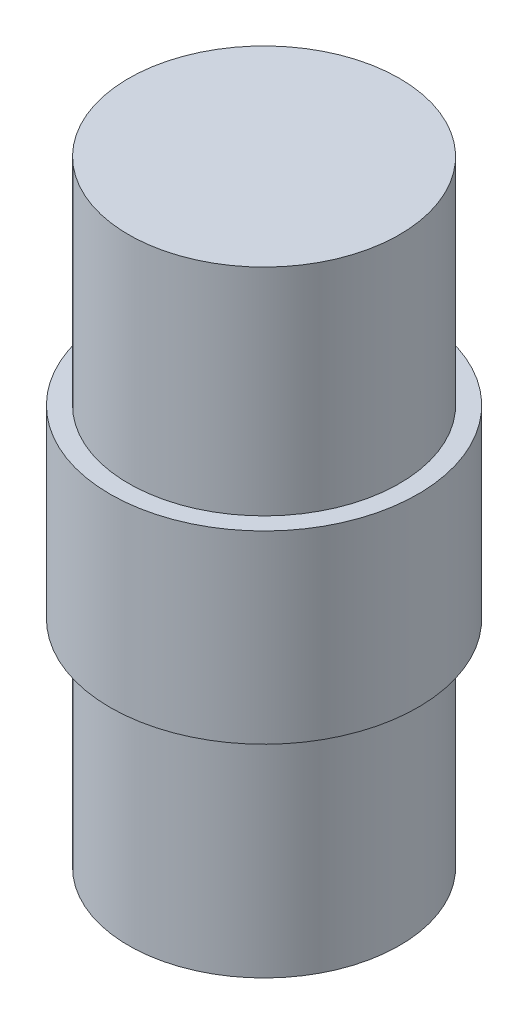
ISO-10303-21;
HEADER;
FILE_DESCRIPTION(('STEP AP214'),'2;1');
FILE_NAME('part.step','',(''),(''),'','','');
FILE_SCHEMA(('AUTOMOTIVE_DESIGN { 1 0 10303 214 1 1 1 1 }'));
ENDSEC;
DATA;
#1=APPLICATION_CONTEXT('core data for automotive mechanical design processes');
#2=APPLICATION_PROTOCOL_DEFINITION('international standard','automotive_design',2000,#1);
#3=PRODUCT_CONTEXT('',#1,'mechanical');
#4=PRODUCT('Part','Part','',(#3));
#5=PRODUCT_RELATED_PRODUCT_CATEGORY('part','',(#4));
#6=PRODUCT_DEFINITION_FORMATION('','',#4);
#7=PRODUCT_DEFINITION_CONTEXT('part definition',#1,'design');
#8=PRODUCT_DEFINITION('design','',#6,#7);
#9=PRODUCT_DEFINITION_SHAPE('','',#8);
#10=(LENGTH_UNIT() NAMED_UNIT(*) SI_UNIT(.MILLI.,.METRE.));
#11=(NAMED_UNIT(*) PLANE_ANGLE_UNIT() SI_UNIT($,.RADIAN.));
#12=(NAMED_UNIT(*) SI_UNIT($,.STERADIAN.) SOLID_ANGLE_UNIT());
#13=UNCERTAINTY_MEASURE_WITH_UNIT(LENGTH_MEASURE(1.E-05),#10,'distance_accuracy_value','');
#14=(GEOMETRIC_REPRESENTATION_CONTEXT(3) GLOBAL_UNCERTAINTY_ASSIGNED_CONTEXT((#13)) GLOBAL_UNIT_ASSIGNED_CONTEXT((#10,
#11,#12)) REPRESENTATION_CONTEXT('',''));
#15=CARTESIAN_POINT('',(0.,0.,0.));
#16=DIRECTION('',(0.,0.,1.));
#17=DIRECTION('',(1.,0.,0.));
#18=AXIS2_PLACEMENT_3D('',#15,#16,#17);
#19=CARTESIAN_POINT('',(0.,15.,0.));
#20=DIRECTION('',(0.,1.,0.));
#21=DIRECTION('',(0.,0.,1.));
#22=AXIS2_PLACEMENT_3D('',#19,#20,#21);
#23=PLANE('',#22);
#24=CARTESIAN_POINT('',(0.,15.,0.));
#25=DIRECTION('',(0.,1.,0.));
#26=DIRECTION('',(0.,0.,1.));
#27=AXIS2_PLACEMENT_3D('',#24,#25,#26);
#28=CIRCLE('',#27,25.);
#29=CARTESIAN_POINT('',(0.,15.,25.));
#30=VERTEX_POINT('',#29);
#31=EDGE_CURVE('E10',#30,#30,#28,.T.);
#32=ORIENTED_EDGE('',*,*,#31,.T.);
#33=EDGE_LOOP('',(#32));
#34=FACE_BOUND('',#33,.T.);
#35=CARTESIAN_POINT('',(0.,15.,0.));
#36=DIRECTION('',(0.,1.,0.));
#37=DIRECTION('',(0.,0.,1.));
#38=AXIS2_PLACEMENT_3D('',#35,#36,#37);
#39=CIRCLE('',#38,22.);
#40=CARTESIAN_POINT('',(0.,15.,-22.));
#41=VERTEX_POINT('',#40);
#42=EDGE_CURVE('E42',#41,#41,#39,.T.);
#43=ORIENTED_EDGE('',*,*,#42,.F.);
#44=EDGE_LOOP('',(#43));
#45=FACE_BOUND('',#44,.T.);
#46=ADVANCED_FACE('F31',(#34,#45),#23,.T.);
#47=CARTESIAN_POINT('',(0.,-15.,0.));
#48=DIRECTION('',(0.,1.,0.));
#49=DIRECTION('',(0.,0.,1.));
#50=AXIS2_PLACEMENT_3D('',#47,#48,#49);
#51=PLANE('',#50);
#52=CARTESIAN_POINT('',(0.,-15.,0.));
#53=DIRECTION('',(0.,1.,0.));
#54=DIRECTION('',(0.,0.,1.));
#55=AXIS2_PLACEMENT_3D('',#52,#53,#54);
#56=CIRCLE('',#55,25.);
#57=CARTESIAN_POINT('',(0.,-15.,25.));
#58=VERTEX_POINT('',#57);
#59=EDGE_CURVE('E38',#58,#58,#56,.T.);
#60=ORIENTED_EDGE('',*,*,#59,.F.);
#61=EDGE_LOOP('',(#60));
#62=FACE_BOUND('',#61,.T.);
#63=CARTESIAN_POINT('',(0.,-15.,0.));
#64=DIRECTION('',(0.,1.,0.));
#65=DIRECTION('',(0.,0.,1.));
#66=AXIS2_PLACEMENT_3D('',#63,#64,#65);
#67=CIRCLE('',#66,22.);
#68=CARTESIAN_POINT('',(0.,-15.,-22.));
#69=VERTEX_POINT('',#68);
#70=EDGE_CURVE('E46',#69,#69,#67,.F.);
#71=ORIENTED_EDGE('',*,*,#70,.F.);
#72=EDGE_LOOP('',(#71));
#73=FACE_BOUND('',#72,.T.);
#74=ADVANCED_FACE('F70',(#62,#73),#51,.F.);
#75=CARTESIAN_POINT('',(0.,15.,0.));
#76=DIRECTION('',(0.,-1.,0.));
#77=DIRECTION('',(0.,0.,-1.));
#78=AXIS2_PLACEMENT_3D('',#75,#76,#77);
#79=CYLINDRICAL_SURFACE('',#78,25.);
#80=ORIENTED_EDGE('',*,*,#31,.F.);
#81=EDGE_LOOP('',(#80));
#82=FACE_BOUND('',#81,.T.);
#83=ORIENTED_EDGE('',*,*,#59,.T.);
#84=EDGE_LOOP('',(#83));
#85=FACE_BOUND('',#84,.T.);
#86=ADVANCED_FACE('F33',(#82,#85),#79,.T.);
#87=CARTESIAN_POINT('',(0.,-50.,0.));
#88=DIRECTION('',(0.,1.,0.));
#89=DIRECTION('',(0.,0.,1.));
#90=AXIS2_PLACEMENT_3D('',#87,#88,#89);
#91=PLANE('',#90);
#92=CARTESIAN_POINT('',(0.,-50.,0.));
#93=DIRECTION('',(0.,1.,0.));
#94=DIRECTION('',(0.,0.,1.));
#95=AXIS2_PLACEMENT_3D('',#92,#93,#94);
#96=CIRCLE('',#95,22.);
#97=CARTESIAN_POINT('',(0.,-50.,-22.));
#98=VERTEX_POINT('',#97);
#99=EDGE_CURVE('E54',#98,#98,#96,.T.);
#100=ORIENTED_EDGE('',*,*,#99,.F.);
#101=EDGE_LOOP('',(#100));
#102=FACE_BOUND('',#101,.T.);
#103=ADVANCED_FACE('F61',(#102),#91,.F.);
#104=CARTESIAN_POINT('',(0.,50.,0.));
#105=DIRECTION('',(0.,-1.,0.));
#106=DIRECTION('',(0.,0.,-1.));
#107=AXIS2_PLACEMENT_3D('',#104,#105,#106);
#108=CYLINDRICAL_SURFACE('',#107,22.);
#109=CARTESIAN_POINT('',(0.,-50.,-22.));
#110=CARTESIAN_POINT('',(0.,-49.6354166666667,-22.));
#111=CARTESIAN_POINT('',(0.,-49.2708333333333,-22.));
#112=CARTESIAN_POINT('',(0.,-48.5416666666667,-22.));
#113=CARTESIAN_POINT('',(0.,-48.1770833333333,-22.));
#114=CARTESIAN_POINT('',(0.,-47.4479166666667,-22.));
#115=CARTESIAN_POINT('',(0.,-47.0833333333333,-22.));
#116=CARTESIAN_POINT('',(0.,-46.3541666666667,-22.));
#117=CARTESIAN_POINT('',(0.,-45.9895833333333,-22.));
#118=CARTESIAN_POINT('',(0.,-45.2604166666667,-22.));
#119=CARTESIAN_POINT('',(0.,-44.8958333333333,-22.));
#120=CARTESIAN_POINT('',(0.,-44.1666666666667,-22.));
#121=CARTESIAN_POINT('',(0.,-43.8020833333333,-22.));
#122=CARTESIAN_POINT('',(0.,-43.0729166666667,-22.));
#123=CARTESIAN_POINT('',(0.,-42.7083333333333,-22.));
#124=CARTESIAN_POINT('',(0.,-41.9791666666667,-22.));
#125=CARTESIAN_POINT('',(0.,-41.6145833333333,-22.));
#126=CARTESIAN_POINT('',(0.,-40.8854166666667,-22.));
#127=CARTESIAN_POINT('',(0.,-40.5208333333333,-22.));
#128=CARTESIAN_POINT('',(0.,-39.7916666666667,-22.));
#129=CARTESIAN_POINT('',(0.,-39.4270833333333,-22.));
#130=CARTESIAN_POINT('',(0.,-38.6979166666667,-22.));
#131=CARTESIAN_POINT('',(0.,-38.3333333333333,-22.));
#132=CARTESIAN_POINT('',(0.,-37.6041666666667,-22.));
#133=CARTESIAN_POINT('',(0.,-37.2395833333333,-22.));
#134=CARTESIAN_POINT('',(0.,-36.5104166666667,-22.));
#135=CARTESIAN_POINT('',(0.,-36.1458333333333,-22.));
#136=CARTESIAN_POINT('',(0.,-35.4166666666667,-22.));
#137=CARTESIAN_POINT('',(0.,-35.0520833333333,-22.));
#138=CARTESIAN_POINT('',(0.,-34.3229166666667,-22.));
#139=CARTESIAN_POINT('',(0.,-33.9583333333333,-22.));
#140=CARTESIAN_POINT('',(0.,-33.2291666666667,-22.));
#141=CARTESIAN_POINT('',(0.,-32.8645833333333,-22.));
#142=CARTESIAN_POINT('',(0.,-32.1354166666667,-22.));
#143=CARTESIAN_POINT('',(0.,-31.7708333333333,-22.));
#144=CARTESIAN_POINT('',(0.,-31.0416666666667,-22.));
#145=CARTESIAN_POINT('',(0.,-30.6770833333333,-22.));
#146=CARTESIAN_POINT('',(0.,-29.9479166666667,-22.));
#147=CARTESIAN_POINT('',(0.,-29.5833333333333,-22.));
#148=CARTESIAN_POINT('',(0.,-28.8541666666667,-22.));
#149=CARTESIAN_POINT('',(0.,-28.4895833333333,-22.));
#150=CARTESIAN_POINT('',(0.,-27.7604166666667,-22.));
#151=CARTESIAN_POINT('',(0.,-27.3958333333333,-22.));
#152=CARTESIAN_POINT('',(0.,-26.6666666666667,-22.));
#153=CARTESIAN_POINT('',(0.,-26.3020833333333,-22.));
#154=CARTESIAN_POINT('',(0.,-25.5729166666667,-22.));
#155=CARTESIAN_POINT('',(0.,-25.2083333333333,-22.));
#156=CARTESIAN_POINT('',(0.,-24.4791666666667,-22.));
#157=CARTESIAN_POINT('',(0.,-24.1145833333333,-22.));
#158=CARTESIAN_POINT('',(0.,-23.3854166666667,-22.));
#159=CARTESIAN_POINT('',(0.,-23.0208333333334,-22.));
#160=CARTESIAN_POINT('',(0.,-22.2916666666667,-22.));
#161=CARTESIAN_POINT('',(0.,-21.9270833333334,-22.));
#162=CARTESIAN_POINT('',(0.,-21.1979166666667,-22.));
#163=CARTESIAN_POINT('',(0.,-20.8333333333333,-22.));
#164=CARTESIAN_POINT('',(0.,-20.1041666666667,-22.));
#165=CARTESIAN_POINT('',(0.,-19.7395833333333,-22.));
#166=CARTESIAN_POINT('',(0.,-19.0104166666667,-22.));
#167=CARTESIAN_POINT('',(0.,-18.6458333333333,-22.));
#168=CARTESIAN_POINT('',(0.,-17.9166666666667,-22.));
#169=CARTESIAN_POINT('',(0.,-17.5520833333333,-22.));
#170=CARTESIAN_POINT('',(0.,-16.8229166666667,-22.));
#171=CARTESIAN_POINT('',(0.,-16.4583333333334,-22.));
#172=CARTESIAN_POINT('',(0.,-15.7291666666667,-22.));
#173=CARTESIAN_POINT('',(0.,-15.3645833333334,-22.));
#174=CARTESIAN_POINT('',(0.,-15.,-22.));
#175=B_SPLINE_CURVE_WITH_KNOTS('',3,(#109,#110,#111,#112,#113,#114,#115,#116,#117,#118,#119,
#120,#121,#122,#123,#124,#125,#126,#127,#128,#129,#130,#131,#132,#133,#134,#135,#136,#137,#138,
#139,#140,#141,#142,#143,#144,#145,#146,#147,#148,#149,#150,#151,#152,#153,#154,#155,#156,#157,
#158,#159,#160,#161,#162,#163,#164,#165,#166,#167,#168,#169,#170,#171,#172,#173,#174),
.UNSPECIFIED.,.F.,.F.,(4,2,2,2,2,2,2,2,2,2,2,2,2,2,2,2,2,2,2,2,2,2,2,2,2,2,2,2,2,2,2,2,4),(0.,
1.09375,2.1875,3.28125,4.37499999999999,5.46874999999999,6.5625,7.65624999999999,
8.74999999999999,9.84375,10.9375,12.03125,13.125,14.21875,15.3125,16.40625,17.5,18.59375,
19.6875,20.78125,21.875,22.96875,24.0625,25.15625,26.25,27.34375,28.4375,29.53125,30.625,
31.71875,32.8125,33.90625,35.),.UNSPECIFIED.);
#176=EDGE_CURVE('BSEAM58',#98,#69,#175,.T.);
#177=ORIENTED_EDGE('',*,*,#99,.T.);
#178=ORIENTED_EDGE('',*,*,#70,.T.);
#179=ORIENTED_EDGE('',*,*,#176,.T.);
#180=ORIENTED_EDGE('',*,*,#176,.F.);
#181=EDGE_LOOP('',(#177,#179,#178,#180));
#182=FACE_BOUND('',#181,.T.);
#183=ADVANCED_FACE('F58',(#182),#108,.T.);
#184=CARTESIAN_POINT('',(0.,50.,0.));
#185=DIRECTION('',(0.,1.,0.));
#186=DIRECTION('',(0.,0.,1.));
#187=AXIS2_PLACEMENT_3D('',#184,#185,#186);
#188=CIRCLE('',#187,22.);
#189=CARTESIAN_POINT('',(0.,50.,-22.));
#190=VERTEX_POINT('',#189);
#191=EDGE_CURVE('E51',#190,#190,#188,.T.);
#192=CARTESIAN_POINT('',(0.,15.,-22.));
#193=CARTESIAN_POINT('',(0.,15.3645833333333,-22.));
#194=CARTESIAN_POINT('',(0.,15.7291666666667,-22.));
#195=CARTESIAN_POINT('',(0.,16.4583333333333,-22.));
#196=CARTESIAN_POINT('',(0.,16.8229166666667,-22.));
#197=CARTESIAN_POINT('',(0.,17.5520833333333,-22.));
#198=CARTESIAN_POINT('',(0.,17.9166666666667,-22.));
#199=CARTESIAN_POINT('',(0.,18.6458333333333,-22.));
#200=CARTESIAN_POINT('',(0.,19.0104166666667,-22.));
#201=CARTESIAN_POINT('',(0.,19.7395833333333,-22.));
#202=CARTESIAN_POINT('',(0.,20.1041666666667,-22.));
#203=CARTESIAN_POINT('',(0.,20.8333333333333,-22.));
#204=CARTESIAN_POINT('',(0.,21.1979166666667,-22.));
#205=CARTESIAN_POINT('',(0.,21.9270833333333,-22.));
#206=CARTESIAN_POINT('',(0.,22.2916666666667,-22.));
#207=CARTESIAN_POINT('',(0.,23.0208333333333,-22.));
#208=CARTESIAN_POINT('',(0.,23.3854166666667,-22.));
#209=CARTESIAN_POINT('',(0.,24.1145833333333,-22.));
#210=CARTESIAN_POINT('',(0.,24.4791666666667,-22.));
#211=CARTESIAN_POINT('',(0.,25.2083333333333,-22.));
#212=CARTESIAN_POINT('',(0.,25.5729166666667,-22.));
#213=CARTESIAN_POINT('',(0.,26.3020833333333,-22.));
#214=CARTESIAN_POINT('',(0.,26.6666666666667,-22.));
#215=CARTESIAN_POINT('',(0.,27.3958333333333,-22.));
#216=CARTESIAN_POINT('',(0.,27.7604166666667,-22.));
#217=CARTESIAN_POINT('',(0.,28.4895833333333,-22.));
#218=CARTESIAN_POINT('',(0.,28.8541666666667,-22.));
#219=CARTESIAN_POINT('',(0.,29.5833333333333,-22.));
#220=CARTESIAN_POINT('',(0.,29.9479166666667,-22.));
#221=CARTESIAN_POINT('',(0.,30.6770833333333,-22.));
#222=CARTESIAN_POINT('',(0.,31.0416666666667,-22.));
#223=CARTESIAN_POINT('',(0.,31.7708333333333,-22.));
#224=CARTESIAN_POINT('',(0.,32.1354166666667,-22.));
#225=CARTESIAN_POINT('',(0.,32.8645833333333,-22.));
#226=CARTESIAN_POINT('',(0.,33.2291666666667,-22.));
#227=CARTESIAN_POINT('',(0.,33.9583333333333,-22.));
#228=CARTESIAN_POINT('',(0.,34.3229166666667,-22.));
#229=CARTESIAN_POINT('',(0.,35.0520833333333,-22.));
#230=CARTESIAN_POINT('',(0.,35.4166666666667,-22.));
#231=CARTESIAN_POINT('',(0.,36.1458333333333,-22.));
#232=CARTESIAN_POINT('',(0.,36.5104166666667,-22.));
#233=CARTESIAN_POINT('',(0.,37.2395833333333,-22.));
#234=CARTESIAN_POINT('',(0.,37.6041666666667,-22.));
#235=CARTESIAN_POINT('',(0.,38.3333333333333,-22.));
#236=CARTESIAN_POINT('',(0.,38.6979166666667,-22.));
#237=CARTESIAN_POINT('',(0.,39.4270833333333,-22.));
#238=CARTESIAN_POINT('',(0.,39.7916666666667,-22.));
#239=CARTESIAN_POINT('',(0.,40.5208333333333,-22.));
#240=CARTESIAN_POINT('',(0.,40.8854166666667,-22.));
#241=CARTESIAN_POINT('',(0.,41.6145833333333,-22.));
#242=CARTESIAN_POINT('',(0.,41.9791666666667,-22.));
#243=CARTESIAN_POINT('',(0.,42.7083333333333,-22.));
#244=CARTESIAN_POINT('',(0.,43.0729166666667,-22.));
#245=CARTESIAN_POINT('',(0.,43.8020833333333,-22.));
#246=CARTESIAN_POINT('',(0.,44.1666666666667,-22.));
#247=CARTESIAN_POINT('',(0.,44.8958333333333,-22.));
#248=CARTESIAN_POINT('',(0.,45.2604166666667,-22.));
#249=CARTESIAN_POINT('',(0.,45.9895833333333,-22.));
#250=CARTESIAN_POINT('',(0.,46.3541666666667,-22.));
#251=CARTESIAN_POINT('',(0.,47.0833333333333,-22.));
#252=CARTESIAN_POINT('',(0.,47.4479166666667,-22.));
#253=CARTESIAN_POINT('',(0.,48.1770833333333,-22.));
#254=CARTESIAN_POINT('',(0.,48.5416666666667,-22.));
#255=CARTESIAN_POINT('',(0.,49.2708333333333,-22.));
#256=CARTESIAN_POINT('',(0.,49.6354166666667,-22.));
#257=CARTESIAN_POINT('',(0.,50.,-22.));
#258=B_SPLINE_CURVE_WITH_KNOTS('',3,(#192,#193,#194,#195,#196,#197,#198,#199,#200,#201,#202,
#203,#204,#205,#206,#207,#208,#209,#210,#211,#212,#213,#214,#215,#216,#217,#218,#219,#220,#221,
#222,#223,#224,#225,#226,#227,#228,#229,#230,#231,#232,#233,#234,#235,#236,#237,#238,#239,#240,
#241,#242,#243,#244,#245,#246,#247,#248,#249,#250,#251,#252,#253,#254,#255,#256,#257),
.UNSPECIFIED.,.F.,.F.,(4,2,2,2,2,2,2,2,2,2,2,2,2,2,2,2,2,2,2,2,2,2,2,2,2,2,2,2,2,2,2,2,4),(0.,
1.09375,2.1875,3.28125,4.375,5.46875,6.5625,7.65625,8.75,9.84374999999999,10.9375,12.03125,
13.125,14.21875,15.3125,16.40625,17.5,18.59375,19.6875,20.78125,21.875,22.96875,24.0625,
25.15625,26.25,27.34375,28.4375,29.53125,30.625,31.71875,32.8125,33.90625,35.),.UNSPECIFIED.);
#259=EDGE_CURVE('BSEAM68',#41,#190,#258,.T.);
#260=ORIENTED_EDGE('',*,*,#42,.T.);
#261=ORIENTED_EDGE('',*,*,#191,.F.);
#262=ORIENTED_EDGE('',*,*,#259,.T.);
#263=ORIENTED_EDGE('',*,*,#259,.F.);
#264=EDGE_LOOP('',(#260,#262,#261,#263));
#265=FACE_BOUND('',#264,.T.);
#266=ADVANCED_FACE('F68',(#265),#108,.T.);
#267=CARTESIAN_POINT('',(0.,50.,0.));
#268=DIRECTION('',(0.,1.,0.));
#269=DIRECTION('',(0.,0.,1.));
#270=AXIS2_PLACEMENT_3D('',#267,#268,#269);
#271=PLANE('',#270);
#272=ORIENTED_EDGE('',*,*,#191,.T.);
#273=EDGE_LOOP('',(#272));
#274=FACE_BOUND('',#273,.T.);
#275=ADVANCED_FACE('F81',(#274),#271,.T.);
#276=CLOSED_SHELL('',(#46,#74,#86,#103,#183,#266,#275));
#277=MANIFOLD_SOLID_BREP('B2',#276);
#278=ADVANCED_BREP_SHAPE_REPRESENTATION('',(#18,#277),#14);
#279=SHAPE_DEFINITION_REPRESENTATION(#9,#278);
ENDSEC;
END-ISO-10303-21;
